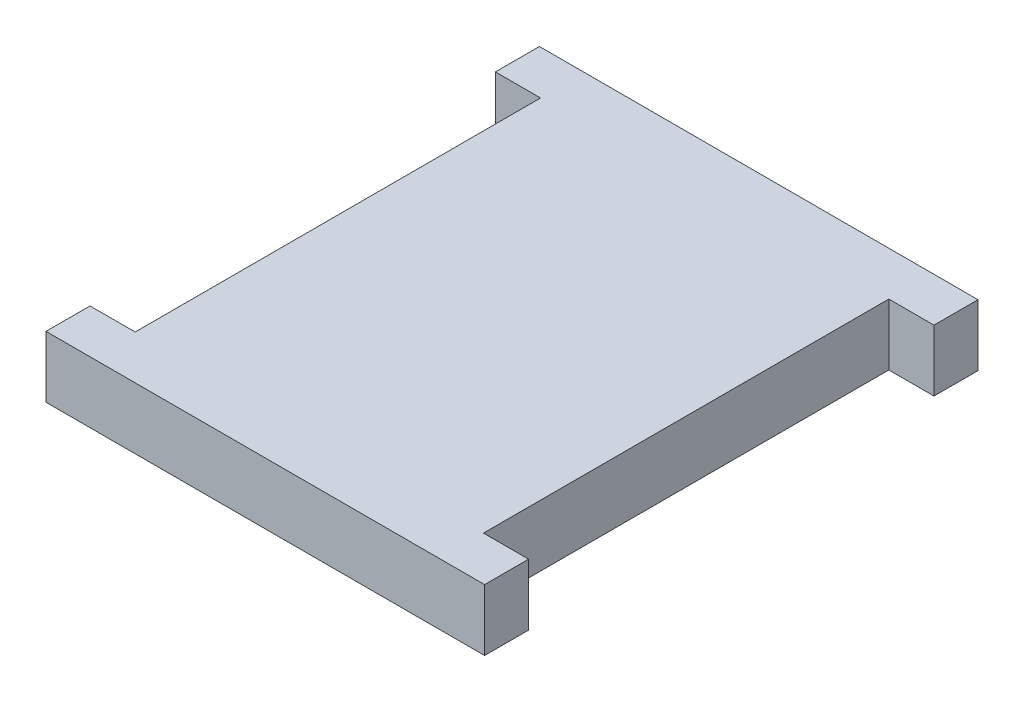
ISO-10303-21;
HEADER;
FILE_DESCRIPTION(('STEP AP214'),'2;1');
FILE_NAME('part.step','',(''),(''),'','','');
FILE_SCHEMA(('AUTOMOTIVE_DESIGN { 1 0 10303 214 1 1 1 1 }'));
ENDSEC;
DATA;
#1=APPLICATION_CONTEXT('core data for automotive mechanical design processes');
#2=APPLICATION_PROTOCOL_DEFINITION('international standard','automotive_design',2000,#1);
#3=PRODUCT_CONTEXT('',#1,'mechanical');
#4=PRODUCT('Part','Part','',(#3));
#5=PRODUCT_RELATED_PRODUCT_CATEGORY('part','',(#4));
#6=PRODUCT_DEFINITION_FORMATION('','',#4);
#7=PRODUCT_DEFINITION_CONTEXT('part definition',#1,'design');
#8=PRODUCT_DEFINITION('design','',#6,#7);
#9=PRODUCT_DEFINITION_SHAPE('','',#8);
#10=(LENGTH_UNIT() NAMED_UNIT(*) SI_UNIT(.MILLI.,.METRE.));
#11=(NAMED_UNIT(*) PLANE_ANGLE_UNIT() SI_UNIT($,.RADIAN.));
#12=(NAMED_UNIT(*) SI_UNIT($,.STERADIAN.) SOLID_ANGLE_UNIT());
#13=UNCERTAINTY_MEASURE_WITH_UNIT(LENGTH_MEASURE(1.E-05),#10,'distance_accuracy_value','');
#14=(GEOMETRIC_REPRESENTATION_CONTEXT(3) GLOBAL_UNCERTAINTY_ASSIGNED_CONTEXT((#13)) GLOBAL_UNIT_ASSIGNED_CONTEXT((#10,
#11,#12)) REPRESENTATION_CONTEXT('',''));
#15=CARTESIAN_POINT('',(0.,0.,0.));
#16=DIRECTION('',(0.,0.,1.));
#17=DIRECTION('',(1.,0.,0.));
#18=AXIS2_PLACEMENT_3D('',#15,#16,#17);
#19=CARTESIAN_POINT('',(68.,9.525,-62.85));
#20=DIRECTION('',(-1.,0.,0.));
#21=DIRECTION('',(0.,0.,1.));
#22=AXIS2_PLACEMENT_3D('',#19,#20,#21);
#23=PLANE('',#22);
#24=DIRECTION('',(0.,0.,-1.));
#25=VECTOR('',#24,1.);
#26=CARTESIAN_POINT('',(68.,-9.525,-62.85));
#27=LINE('',#26,#25);
#28=CARTESIAN_POINT('',(68.,-9.525,-62.85));
#29=VERTEX_POINT('',#28);
#30=CARTESIAN_POINT('',(68.,-9.525,-76.5));
#31=VERTEX_POINT('',#30);
#32=EDGE_CURVE('E159',#29,#31,#27,.T.);
#33=ORIENTED_EDGE('',*,*,#32,.T.);
#34=DIRECTION('',(0.,-1.,0.));
#35=VECTOR('',#34,1.);
#36=CARTESIAN_POINT('',(68.,9.525,-76.5));
#37=LINE('',#36,#35);
#38=CARTESIAN_POINT('',(68.,9.525,-76.5));
#39=VERTEX_POINT('',#38);
#40=EDGE_CURVE('E11',#39,#31,#37,.T.);
#41=ORIENTED_EDGE('',*,*,#40,.F.);
#42=DIRECTION('',(0.,0.,-1.));
#43=VECTOR('',#42,1.);
#44=CARTESIAN_POINT('',(68.,9.525,-62.85));
#45=LINE('',#44,#43);
#46=CARTESIAN_POINT('',(68.,9.525,-62.85));
#47=VERTEX_POINT('',#46);
#48=EDGE_CURVE('E181',#47,#39,#45,.T.);
#49=ORIENTED_EDGE('',*,*,#48,.F.);
#50=DIRECTION('',(0.,-1.,0.));
#51=VECTOR('',#50,1.);
#52=CARTESIAN_POINT('',(68.,9.525,-62.85));
#53=LINE('',#52,#51);
#54=EDGE_CURVE('E155',#47,#29,#53,.T.);
#55=ORIENTED_EDGE('',*,*,#54,.T.);
#56=EDGE_LOOP('',(#33,#41,#49,#55));
#57=FACE_BOUND('',#56,.T.);
#58=ADVANCED_FACE('F39',(#57),#23,.F.);
#59=CARTESIAN_POINT('',(-68.,9.525,-76.5));
#60=DIRECTION('',(0.,0.,1.));
#61=DIRECTION('',(1.,0.,0.));
#62=AXIS2_PLACEMENT_3D('',#59,#60,#61);
#63=PLANE('',#62);
#64=DIRECTION('',(-1.,0.,0.));
#65=VECTOR('',#64,1.);
#66=CARTESIAN_POINT('',(-68.,-9.525,-76.5));
#67=LINE('',#66,#65);
#68=CARTESIAN_POINT('',(-68.,-9.525,-76.5));
#69=VERTEX_POINT('',#68);
#70=EDGE_CURVE('E162',#31,#69,#67,.T.);
#71=ORIENTED_EDGE('',*,*,#70,.T.);
#72=DIRECTION('',(0.,-1.,0.));
#73=VECTOR('',#72,1.);
#74=CARTESIAN_POINT('',(-68.,9.525,-76.5));
#75=LINE('',#74,#73);
#76=CARTESIAN_POINT('',(-68.,9.525,-76.5));
#77=VERTEX_POINT('',#76);
#78=EDGE_CURVE('E47',#77,#69,#75,.T.);
#79=ORIENTED_EDGE('',*,*,#78,.F.);
#80=DIRECTION('',(-1.,0.,0.));
#81=VECTOR('',#80,1.);
#82=CARTESIAN_POINT('',(-68.,9.525,-76.5));
#83=LINE('',#82,#81);
#84=EDGE_CURVE('E110',#39,#77,#83,.T.);
#85=ORIENTED_EDGE('',*,*,#84,.F.);
#86=ORIENTED_EDGE('',*,*,#40,.T.);
#87=EDGE_LOOP('',(#71,#79,#85,#86));
#88=FACE_BOUND('',#87,.T.);
#89=ADVANCED_FACE('F259',(#88),#63,.F.);
#90=CARTESIAN_POINT('',(-68.,9.525,-62.85));
#91=DIRECTION('',(1.,0.,0.));
#92=DIRECTION('',(0.,0.,-1.));
#93=AXIS2_PLACEMENT_3D('',#90,#91,#92);
#94=PLANE('',#93);
#95=DIRECTION('',(0.,0.,1.));
#96=VECTOR('',#95,1.);
#97=CARTESIAN_POINT('',(-68.,-9.525,-62.85));
#98=LINE('',#97,#96);
#99=CARTESIAN_POINT('',(-68.,-9.525,-62.85));
#100=VERTEX_POINT('',#99);
#101=EDGE_CURVE('E164',#69,#100,#98,.T.);
#102=ORIENTED_EDGE('',*,*,#101,.T.);
#103=DIRECTION('',(0.,-1.,0.));
#104=VECTOR('',#103,1.);
#105=CARTESIAN_POINT('',(-68.,9.525,-62.85));
#106=LINE('',#105,#104);
#107=CARTESIAN_POINT('',(-68.,9.525,-62.85));
#108=VERTEX_POINT('',#107);
#109=EDGE_CURVE('E200',#108,#100,#106,.T.);
#110=ORIENTED_EDGE('',*,*,#109,.F.);
#111=DIRECTION('',(0.,0.,1.));
#112=VECTOR('',#111,1.);
#113=CARTESIAN_POINT('',(-68.,9.525,-62.85));
#114=LINE('',#113,#112);
#115=EDGE_CURVE('E208',#77,#108,#114,.T.);
#116=ORIENTED_EDGE('',*,*,#115,.F.);
#117=ORIENTED_EDGE('',*,*,#78,.T.);
#118=EDGE_LOOP('',(#102,#110,#116,#117));
#119=FACE_BOUND('',#118,.T.);
#120=ADVANCED_FACE('F206',(#119),#94,.F.);
#121=CARTESIAN_POINT('',(-68.,9.525,-62.85));
#122=DIRECTION('',(0.,0.,-1.));
#123=DIRECTION('',(-1.,0.,0.));
#124=AXIS2_PLACEMENT_3D('',#121,#122,#123);
#125=PLANE('',#124);
#126=DIRECTION('',(1.,0.,0.));
#127=VECTOR('',#126,1.);
#128=CARTESIAN_POINT('',(-68.,-9.525,-62.85));
#129=LINE('',#128,#127);
#130=CARTESIAN_POINT('',(-54.0000000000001,-9.525,-62.85));
#131=VERTEX_POINT('',#130);
#132=EDGE_CURVE('E166',#100,#131,#129,.T.);
#133=ORIENTED_EDGE('',*,*,#132,.T.);
#134=DIRECTION('',(0.,-1.,0.));
#135=VECTOR('',#134,1.);
#136=CARTESIAN_POINT('',(-54.0000000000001,9.525,-62.85));
#137=LINE('',#136,#135);
#138=CARTESIAN_POINT('',(-54.0000000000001,9.525,-62.85));
#139=VERTEX_POINT('',#138);
#140=EDGE_CURVE('E197',#139,#131,#137,.T.);
#141=ORIENTED_EDGE('',*,*,#140,.F.);
#142=DIRECTION('',(1.,0.,0.));
#143=VECTOR('',#142,1.);
#144=CARTESIAN_POINT('',(-68.,9.525,-62.85));
#145=LINE('',#144,#143);
#146=EDGE_CURVE('E226',#108,#139,#145,.T.);
#147=ORIENTED_EDGE('',*,*,#146,.F.);
#148=ORIENTED_EDGE('',*,*,#109,.T.);
#149=EDGE_LOOP('',(#133,#141,#147,#148));
#150=FACE_BOUND('',#149,.T.);
#151=ADVANCED_FACE('F217',(#150),#125,.F.);
#152=CARTESIAN_POINT('',(-54.0000000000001,9.525,-62.85));
#153=DIRECTION('',(1.,0.,0.));
#154=DIRECTION('',(0.,0.,-1.));
#155=AXIS2_PLACEMENT_3D('',#152,#153,#154);
#156=PLANE('',#155);
#157=DIRECTION('',(0.,0.,1.));
#158=VECTOR('',#157,1.);
#159=CARTESIAN_POINT('',(-54.0000000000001,-9.525,-62.85));
#160=LINE('',#159,#158);
#161=CARTESIAN_POINT('',(-54.,-9.525,62.8500000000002));
#162=VERTEX_POINT('',#161);
#163=EDGE_CURVE('E168',#131,#162,#160,.T.);
#164=ORIENTED_EDGE('',*,*,#163,.T.);
#165=DIRECTION('',(0.,-1.,0.));
#166=VECTOR('',#165,1.);
#167=CARTESIAN_POINT('',(-54.,9.525,62.8500000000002));
#168=LINE('',#167,#166);
#169=CARTESIAN_POINT('',(-54.,9.525,62.8500000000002));
#170=VERTEX_POINT('',#169);
#171=EDGE_CURVE('E194',#170,#162,#168,.T.);
#172=ORIENTED_EDGE('',*,*,#171,.F.);
#173=DIRECTION('',(0.,0.,1.));
#174=VECTOR('',#173,1.);
#175=CARTESIAN_POINT('',(-54.0000000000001,9.525,-62.85));
#176=LINE('',#175,#174);
#177=EDGE_CURVE('E223',#139,#170,#176,.T.);
#178=ORIENTED_EDGE('',*,*,#177,.F.);
#179=ORIENTED_EDGE('',*,*,#140,.T.);
#180=EDGE_LOOP('',(#164,#172,#178,#179));
#181=FACE_BOUND('',#180,.T.);
#182=ADVANCED_FACE('F221',(#181),#156,.F.);
#183=CARTESIAN_POINT('',(-54.,9.525,62.8500000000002));
#184=DIRECTION('',(0.,0.,1.));
#185=DIRECTION('',(1.,0.,0.));
#186=AXIS2_PLACEMENT_3D('',#183,#184,#185);
#187=PLANE('',#186);
#188=DIRECTION('',(-1.,0.,0.));
#189=VECTOR('',#188,1.);
#190=CARTESIAN_POINT('',(-54.,-9.525,62.8500000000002));
#191=LINE('',#190,#189);
#192=CARTESIAN_POINT('',(-68.,-9.525,62.8500000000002));
#193=VERTEX_POINT('',#192);
#194=EDGE_CURVE('E170',#162,#193,#191,.T.);
#195=ORIENTED_EDGE('',*,*,#194,.T.);
#196=DIRECTION('',(0.,-1.,0.));
#197=VECTOR('',#196,1.);
#198=CARTESIAN_POINT('',(-68.,9.525,62.8500000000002));
#199=LINE('',#198,#197);
#200=CARTESIAN_POINT('',(-68.,9.525,62.8500000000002));
#201=VERTEX_POINT('',#200);
#202=EDGE_CURVE('E191',#201,#193,#199,.T.);
#203=ORIENTED_EDGE('',*,*,#202,.F.);
#204=DIRECTION('',(-1.,0.,0.));
#205=VECTOR('',#204,1.);
#206=CARTESIAN_POINT('',(-54.,9.525,62.8500000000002));
#207=LINE('',#206,#205);
#208=EDGE_CURVE('E225',#170,#201,#207,.T.);
#209=ORIENTED_EDGE('',*,*,#208,.F.);
#210=ORIENTED_EDGE('',*,*,#171,.T.);
#211=EDGE_LOOP('',(#195,#203,#209,#210));
#212=FACE_BOUND('',#211,.T.);
#213=ADVANCED_FACE('F272',(#212),#187,.F.);
#214=CARTESIAN_POINT('',(-68.,9.525,76.5));
#215=DIRECTION('',(1.,0.,0.));
#216=DIRECTION('',(0.,0.,-1.));
#217=AXIS2_PLACEMENT_3D('',#214,#215,#216);
#218=PLANE('',#217);
#219=DIRECTION('',(0.,0.,1.));
#220=VECTOR('',#219,1.);
#221=CARTESIAN_POINT('',(-68.,-9.525,76.5));
#222=LINE('',#221,#220);
#223=CARTESIAN_POINT('',(-68.,-9.525,76.5));
#224=VERTEX_POINT('',#223);
#225=EDGE_CURVE('E172',#193,#224,#222,.T.);
#226=ORIENTED_EDGE('',*,*,#225,.T.);
#227=DIRECTION('',(0.,-1.,0.));
#228=VECTOR('',#227,1.);
#229=CARTESIAN_POINT('',(-68.,9.525,76.5));
#230=LINE('',#229,#228);
#231=CARTESIAN_POINT('',(-68.,9.525,76.5));
#232=VERTEX_POINT('',#231);
#233=EDGE_CURVE('E188',#232,#224,#230,.T.);
#234=ORIENTED_EDGE('',*,*,#233,.F.);
#235=DIRECTION('',(0.,0.,1.));
#236=VECTOR('',#235,1.);
#237=CARTESIAN_POINT('',(-68.,9.525,76.5));
#238=LINE('',#237,#236);
#239=EDGE_CURVE('E228',#201,#232,#238,.T.);
#240=ORIENTED_EDGE('',*,*,#239,.F.);
#241=ORIENTED_EDGE('',*,*,#202,.T.);
#242=EDGE_LOOP('',(#226,#234,#240,#241));
#243=FACE_BOUND('',#242,.T.);
#244=ADVANCED_FACE('F275',(#243),#218,.F.);
#245=CARTESIAN_POINT('',(-68.,9.525,76.5));
#246=DIRECTION('',(0.,0.,-1.));
#247=DIRECTION('',(-1.,0.,0.));
#248=AXIS2_PLACEMENT_3D('',#245,#246,#247);
#249=PLANE('',#248);
#250=DIRECTION('',(1.,0.,0.));
#251=VECTOR('',#250,1.);
#252=CARTESIAN_POINT('',(-68.,-9.525,76.5));
#253=LINE('',#252,#251);
#254=CARTESIAN_POINT('',(68.,-9.525,76.5));
#255=VERTEX_POINT('',#254);
#256=EDGE_CURVE('E174',#224,#255,#253,.T.);
#257=ORIENTED_EDGE('',*,*,#256,.T.);
#258=DIRECTION('',(0.,-1.,0.));
#259=VECTOR('',#258,1.);
#260=CARTESIAN_POINT('',(68.,9.525,76.5));
#261=LINE('',#260,#259);
#262=CARTESIAN_POINT('',(68.,9.525,76.5));
#263=VERTEX_POINT('',#262);
#264=EDGE_CURVE('E185',#263,#255,#261,.T.);
#265=ORIENTED_EDGE('',*,*,#264,.F.);
#266=DIRECTION('',(1.,0.,0.));
#267=VECTOR('',#266,1.);
#268=CARTESIAN_POINT('',(-68.,9.525,76.5));
#269=LINE('',#268,#267);
#270=EDGE_CURVE('E234',#232,#263,#269,.T.);
#271=ORIENTED_EDGE('',*,*,#270,.F.);
#272=ORIENTED_EDGE('',*,*,#233,.T.);
#273=EDGE_LOOP('',(#257,#265,#271,#272));
#274=FACE_BOUND('',#273,.T.);
#275=ADVANCED_FACE('F240',(#274),#249,.F.);
#276=CARTESIAN_POINT('',(68.,9.525,76.5));
#277=DIRECTION('',(-1.,0.,0.));
#278=DIRECTION('',(0.,0.,1.));
#279=AXIS2_PLACEMENT_3D('',#276,#277,#278);
#280=PLANE('',#279);
#281=DIRECTION('',(0.,0.,-1.));
#282=VECTOR('',#281,1.);
#283=CARTESIAN_POINT('',(68.,-9.525,76.5));
#284=LINE('',#283,#282);
#285=CARTESIAN_POINT('',(68.,-9.525,62.85));
#286=VERTEX_POINT('',#285);
#287=EDGE_CURVE('E176',#255,#286,#284,.T.);
#288=ORIENTED_EDGE('',*,*,#287,.T.);
#289=DIRECTION('',(0.,-1.,0.));
#290=VECTOR('',#289,1.);
#291=CARTESIAN_POINT('',(68.,9.525,62.85));
#292=LINE('',#291,#290);
#293=CARTESIAN_POINT('',(68.,9.525,62.85));
#294=VERTEX_POINT('',#293);
#295=EDGE_CURVE('E150',#294,#286,#292,.T.);
#296=ORIENTED_EDGE('',*,*,#295,.F.);
#297=DIRECTION('',(0.,0.,-1.));
#298=VECTOR('',#297,1.);
#299=CARTESIAN_POINT('',(68.,9.525,76.5));
#300=LINE('',#299,#298);
#301=EDGE_CURVE('E141',#263,#294,#300,.T.);
#302=ORIENTED_EDGE('',*,*,#301,.F.);
#303=ORIENTED_EDGE('',*,*,#264,.T.);
#304=EDGE_LOOP('',(#288,#296,#302,#303));
#305=FACE_BOUND('',#304,.T.);
#306=ADVANCED_FACE('F244',(#305),#280,.F.);
#307=CARTESIAN_POINT('',(54.,9.525,62.85));
#308=DIRECTION('',(0.,0.,1.));
#309=DIRECTION('',(1.,0.,0.));
#310=AXIS2_PLACEMENT_3D('',#307,#308,#309);
#311=PLANE('',#310);
#312=DIRECTION('',(-1.,0.,0.));
#313=VECTOR('',#312,1.);
#314=CARTESIAN_POINT('',(54.,-9.525,62.85));
#315=LINE('',#314,#313);
#316=CARTESIAN_POINT('',(54.,-9.525,62.85));
#317=VERTEX_POINT('',#316);
#318=EDGE_CURVE('E149',#286,#317,#315,.T.);
#319=ORIENTED_EDGE('',*,*,#318,.T.);
#320=DIRECTION('',(0.,-1.,0.));
#321=VECTOR('',#320,1.);
#322=CARTESIAN_POINT('',(54.,9.525,62.85));
#323=LINE('',#322,#321);
#324=CARTESIAN_POINT('',(54.,9.525,62.85));
#325=VERTEX_POINT('',#324);
#326=EDGE_CURVE('E146',#325,#317,#323,.T.);
#327=ORIENTED_EDGE('',*,*,#326,.F.);
#328=DIRECTION('',(-1.,0.,0.));
#329=VECTOR('',#328,1.);
#330=CARTESIAN_POINT('',(54.,9.525,62.85));
#331=LINE('',#330,#329);
#332=EDGE_CURVE('E135',#294,#325,#331,.T.);
#333=ORIENTED_EDGE('',*,*,#332,.F.);
#334=ORIENTED_EDGE('',*,*,#295,.T.);
#335=EDGE_LOOP('',(#319,#327,#333,#334));
#336=FACE_BOUND('',#335,.T.);
#337=ADVANCED_FACE('F147',(#336),#311,.F.);
#338=CARTESIAN_POINT('',(54.,9.525,-62.85));
#339=DIRECTION('',(-1.,0.,0.));
#340=DIRECTION('',(0.,0.,1.));
#341=AXIS2_PLACEMENT_3D('',#338,#339,#340);
#342=PLANE('',#341);
#343=DIRECTION('',(0.,0.,-1.));
#344=VECTOR('',#343,1.);
#345=CARTESIAN_POINT('',(54.,-9.525,-62.85));
#346=LINE('',#345,#344);
#347=CARTESIAN_POINT('',(54.,-9.525,-62.85));
#348=VERTEX_POINT('',#347);
#349=EDGE_CURVE('E96',#317,#348,#346,.T.);
#350=ORIENTED_EDGE('',*,*,#349,.T.);
#351=DIRECTION('',(0.,-1.,0.));
#352=VECTOR('',#351,1.);
#353=CARTESIAN_POINT('',(54.,9.525,-62.85));
#354=LINE('',#353,#352);
#355=CARTESIAN_POINT('',(54.,9.525,-62.85));
#356=VERTEX_POINT('',#355);
#357=EDGE_CURVE('E151',#356,#348,#354,.T.);
#358=ORIENTED_EDGE('',*,*,#357,.F.);
#359=DIRECTION('',(0.,0.,-1.));
#360=VECTOR('',#359,1.);
#361=CARTESIAN_POINT('',(54.,9.525,-62.85));
#362=LINE('',#361,#360);
#363=EDGE_CURVE('E139',#325,#356,#362,.T.);
#364=ORIENTED_EDGE('',*,*,#363,.F.);
#365=ORIENTED_EDGE('',*,*,#326,.T.);
#366=EDGE_LOOP('',(#350,#358,#364,#365));
#367=FACE_BOUND('',#366,.T.);
#368=ADVANCED_FACE('F153',(#367),#342,.F.);
#369=CARTESIAN_POINT('',(68.,9.525,-62.85));
#370=DIRECTION('',(0.,0.,-1.));
#371=DIRECTION('',(-1.,0.,0.));
#372=AXIS2_PLACEMENT_3D('',#369,#370,#371);
#373=PLANE('',#372);
#374=DIRECTION('',(1.,0.,0.));
#375=VECTOR('',#374,1.);
#376=CARTESIAN_POINT('',(68.,-9.525,-62.85));
#377=LINE('',#376,#375);
#378=EDGE_CURVE('E102',#348,#29,#377,.T.);
#379=ORIENTED_EDGE('',*,*,#378,.T.);
#380=ORIENTED_EDGE('',*,*,#54,.F.);
#381=DIRECTION('',(1.,0.,0.));
#382=VECTOR('',#381,1.);
#383=CARTESIAN_POINT('',(68.,9.525,-62.85));
#384=LINE('',#383,#382);
#385=EDGE_CURVE('E55',#356,#47,#384,.T.);
#386=ORIENTED_EDGE('',*,*,#385,.F.);
#387=ORIENTED_EDGE('',*,*,#357,.T.);
#388=EDGE_LOOP('',(#379,#380,#386,#387));
#389=FACE_BOUND('',#388,.T.);
#390=ADVANCED_FACE('F248',(#389),#373,.F.);
#391=CARTESIAN_POINT('',(0.,9.525,0.));
#392=DIRECTION('',(0.,-1.,0.));
#393=DIRECTION('',(0.,0.,-1.));
#394=AXIS2_PLACEMENT_3D('',#391,#392,#393);
#395=PLANE('',#394);
#396=ORIENTED_EDGE('',*,*,#48,.T.);
#397=ORIENTED_EDGE('',*,*,#84,.T.);
#398=ORIENTED_EDGE('',*,*,#115,.T.);
#399=ORIENTED_EDGE('',*,*,#146,.T.);
#400=ORIENTED_EDGE('',*,*,#177,.T.);
#401=ORIENTED_EDGE('',*,*,#208,.T.);
#402=ORIENTED_EDGE('',*,*,#239,.T.);
#403=ORIENTED_EDGE('',*,*,#270,.T.);
#404=ORIENTED_EDGE('',*,*,#301,.T.);
#405=ORIENTED_EDGE('',*,*,#332,.T.);
#406=ORIENTED_EDGE('',*,*,#363,.T.);
#407=ORIENTED_EDGE('',*,*,#385,.T.);
#408=EDGE_LOOP('',(#396,#397,#398,#399,#400,#401,#402,#403,#404,#405,#406,#407));
#409=FACE_BOUND('',#408,.T.);
#410=ADVANCED_FACE('F137',(#409),#395,.F.);
#411=CARTESIAN_POINT('',(0.,-9.525,0.));
#412=DIRECTION('',(0.,-1.,0.));
#413=DIRECTION('',(0.,0.,-1.));
#414=AXIS2_PLACEMENT_3D('',#411,#412,#413);
#415=PLANE('',#414);
#416=ORIENTED_EDGE('',*,*,#32,.F.);
#417=ORIENTED_EDGE('',*,*,#378,.F.);
#418=ORIENTED_EDGE('',*,*,#349,.F.);
#419=ORIENTED_EDGE('',*,*,#318,.F.);
#420=ORIENTED_EDGE('',*,*,#287,.F.);
#421=ORIENTED_EDGE('',*,*,#256,.F.);
#422=ORIENTED_EDGE('',*,*,#225,.F.);
#423=ORIENTED_EDGE('',*,*,#194,.F.);
#424=ORIENTED_EDGE('',*,*,#163,.F.);
#425=ORIENTED_EDGE('',*,*,#132,.F.);
#426=ORIENTED_EDGE('',*,*,#101,.F.);
#427=ORIENTED_EDGE('',*,*,#70,.F.);
#428=EDGE_LOOP('',(#416,#417,#418,#419,#420,#421,#422,#423,#424,#425,#426,#427));
#429=FACE_BOUND('',#428,.T.);
#430=ADVANCED_FACE('F212',(#429),#415,.T.);
#431=CLOSED_SHELL('',(#58,#89,#120,#151,#182,#213,#244,#275,#306,#337,#368,#390,#410,#430));
#432=MANIFOLD_SOLID_BREP('B2',#431);
#433=ADVANCED_BREP_SHAPE_REPRESENTATION('',(#18,#432),#14);
#434=SHAPE_DEFINITION_REPRESENTATION(#9,#433);
ENDSEC;
END-ISO-10303-21;
